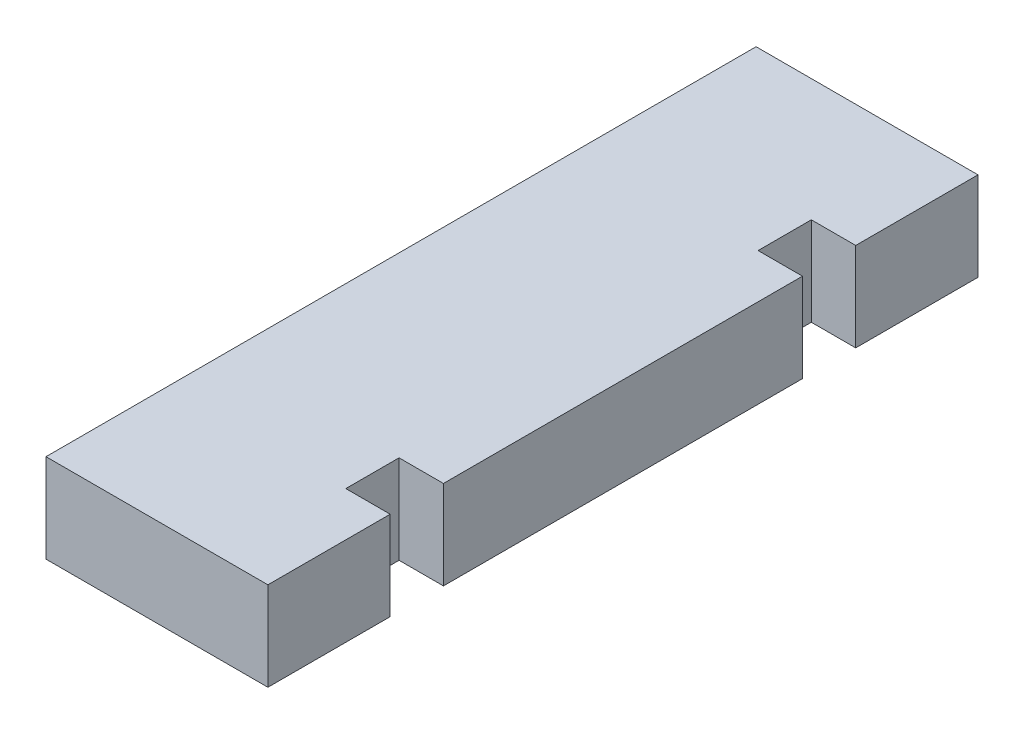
ISO-10303-21;
HEADER;
FILE_DESCRIPTION(('STEP AP214'),'2;1');
FILE_NAME('part.step','',(''),(''),'','','');
FILE_SCHEMA(('AUTOMOTIVE_DESIGN { 1 0 10303 214 1 1 1 1 }'));
ENDSEC;
DATA;
#1=APPLICATION_CONTEXT('core data for automotive mechanical design processes');
#2=APPLICATION_PROTOCOL_DEFINITION('international standard','automotive_design',2000,#1);
#3=PRODUCT_CONTEXT('',#1,'mechanical');
#4=PRODUCT('Part','Part','',(#3));
#5=PRODUCT_RELATED_PRODUCT_CATEGORY('part','',(#4));
#6=PRODUCT_DEFINITION_FORMATION('','',#4);
#7=PRODUCT_DEFINITION_CONTEXT('part definition',#1,'design');
#8=PRODUCT_DEFINITION('design','',#6,#7);
#9=PRODUCT_DEFINITION_SHAPE('','',#8);
#10=(LENGTH_UNIT() NAMED_UNIT(*) SI_UNIT(.MILLI.,.METRE.));
#11=(NAMED_UNIT(*) PLANE_ANGLE_UNIT() SI_UNIT($,.RADIAN.));
#12=(NAMED_UNIT(*) SI_UNIT($,.STERADIAN.) SOLID_ANGLE_UNIT());
#13=UNCERTAINTY_MEASURE_WITH_UNIT(LENGTH_MEASURE(1.E-05),#10,'distance_accuracy_value','');
#14=(GEOMETRIC_REPRESENTATION_CONTEXT(3) GLOBAL_UNCERTAINTY_ASSIGNED_CONTEXT((#13)) GLOBAL_UNIT_ASSIGNED_CONTEXT((#10,
#11,#12)) REPRESENTATION_CONTEXT('',''));
#15=CARTESIAN_POINT('',(0.,0.,0.));
#16=DIRECTION('',(0.,0.,1.));
#17=DIRECTION('',(1.,0.,0.));
#18=AXIS2_PLACEMENT_3D('',#15,#16,#17);
#19=CARTESIAN_POINT('',(25.,0.,-80.));
#20=DIRECTION('',(1.,0.,0.));
#21=DIRECTION('',(0.,0.,-1.));
#22=AXIS2_PLACEMENT_3D('',#19,#20,#21);
#23=PLANE('',#22);
#24=DIRECTION('',(0.,1.,0.));
#25=VECTOR('',#24,1.);
#26=CARTESIAN_POINT('',(25.,10.,-66.2237081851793));
#27=LINE('',#26,#25);
#28=CARTESIAN_POINT('',(25.,0.,-66.2237081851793));
#29=VERTEX_POINT('',#28);
#30=CARTESIAN_POINT('',(25.,10.,-66.2237081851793));
#31=VERTEX_POINT('',#30);
#32=EDGE_CURVE('E134',#29,#31,#27,.T.);
#33=ORIENTED_EDGE('',*,*,#32,.F.);
#34=DIRECTION('',(0.,0.,1.));
#35=VECTOR('',#34,1.);
#36=CARTESIAN_POINT('',(25.,0.,-80.));
#37=LINE('',#36,#35);
#38=CARTESIAN_POINT('',(25.,0.,-80.));
#39=VERTEX_POINT('',#38);
#40=EDGE_CURVE('E144',#39,#29,#37,.T.);
#41=ORIENTED_EDGE('',*,*,#40,.F.);
#42=DIRECTION('',(0.,1.,0.));
#43=VECTOR('',#42,1.);
#44=CARTESIAN_POINT('',(25.,0.,-80.));
#45=LINE('',#44,#43);
#46=CARTESIAN_POINT('',(25.,10.,-80.));
#47=VERTEX_POINT('',#46);
#48=EDGE_CURVE('E160',#39,#47,#45,.T.);
#49=ORIENTED_EDGE('',*,*,#48,.T.);
#50=DIRECTION('',(0.,0.,1.));
#51=VECTOR('',#50,1.);
#52=CARTESIAN_POINT('',(25.,10.,-80.));
#53=LINE('',#52,#51);
#54=EDGE_CURVE('E35',#47,#31,#53,.T.);
#55=ORIENTED_EDGE('',*,*,#54,.T.);
#56=EDGE_LOOP('',(#33,#41,#49,#55));
#57=FACE_BOUND('',#56,.T.);
#58=ADVANCED_FACE('F26',(#57),#23,.T.);
#59=DIRECTION('',(0.,-1.,0.));
#60=VECTOR('',#59,1.);
#61=CARTESIAN_POINT('',(25.,10.,-13.7762918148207));
#62=LINE('',#61,#60);
#63=CARTESIAN_POINT('',(25.,10.,-13.7762918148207));
#64=VERTEX_POINT('',#63);
#65=CARTESIAN_POINT('',(25.,0.,-13.7762918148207));
#66=VERTEX_POINT('',#65);
#67=EDGE_CURVE('E199',#64,#66,#62,.T.);
#68=ORIENTED_EDGE('',*,*,#67,.F.);
#69=CARTESIAN_POINT('',(25.,10.,0.));
#70=VERTEX_POINT('',#69);
#71=EDGE_CURVE('E141',#64,#70,#53,.T.);
#72=ORIENTED_EDGE('',*,*,#71,.T.);
#73=DIRECTION('',(0.,1.,0.));
#74=VECTOR('',#73,1.);
#75=CARTESIAN_POINT('',(25.,0.,0.));
#76=LINE('',#75,#74);
#77=CARTESIAN_POINT('',(25.,0.,0.));
#78=VERTEX_POINT('',#77);
#79=EDGE_CURVE('E172',#78,#70,#76,.T.);
#80=ORIENTED_EDGE('',*,*,#79,.F.);
#81=EDGE_CURVE('E147',#66,#78,#37,.T.);
#82=ORIENTED_EDGE('',*,*,#81,.F.);
#83=EDGE_LOOP('',(#68,#72,#80,#82));
#84=FACE_BOUND('',#83,.T.);
#85=ADVANCED_FACE('F230',(#84),#23,.T.);
#86=CARTESIAN_POINT('',(0.,0.,-80.));
#87=DIRECTION('',(-1.,0.,0.));
#88=DIRECTION('',(0.,0.,1.));
#89=AXIS2_PLACEMENT_3D('',#86,#87,#88);
#90=PLANE('',#89);
#91=DIRECTION('',(0.,-1.,0.));
#92=VECTOR('',#91,1.);
#93=CARTESIAN_POINT('',(0.,0.,0.));
#94=LINE('',#93,#92);
#95=CARTESIAN_POINT('',(0.,10.,0.));
#96=VERTEX_POINT('',#95);
#97=CARTESIAN_POINT('',(0.,0.,0.));
#98=VERTEX_POINT('',#97);
#99=EDGE_CURVE('E178',#96,#98,#94,.T.);
#100=ORIENTED_EDGE('',*,*,#99,.F.);
#101=DIRECTION('',(0.,0.,1.));
#102=VECTOR('',#101,1.);
#103=CARTESIAN_POINT('',(0.,10.,-80.));
#104=LINE('',#103,#102);
#105=CARTESIAN_POINT('',(0.,10.,-80.));
#106=VERTEX_POINT('',#105);
#107=EDGE_CURVE('E11',#106,#96,#104,.T.);
#108=ORIENTED_EDGE('',*,*,#107,.F.);
#109=DIRECTION('',(0.,-1.,0.));
#110=VECTOR('',#109,1.);
#111=CARTESIAN_POINT('',(0.,0.,-80.));
#112=LINE('',#111,#110);
#113=CARTESIAN_POINT('',(0.,0.,-80.));
#114=VERTEX_POINT('',#113);
#115=EDGE_CURVE('E167',#106,#114,#112,.T.);
#116=ORIENTED_EDGE('',*,*,#115,.T.);
#117=DIRECTION('',(0.,0.,1.));
#118=VECTOR('',#117,1.);
#119=CARTESIAN_POINT('',(0.,0.,-80.));
#120=LINE('',#119,#118);
#121=EDGE_CURVE('E30',#114,#98,#120,.T.);
#122=ORIENTED_EDGE('',*,*,#121,.T.);
#123=EDGE_LOOP('',(#100,#108,#116,#122));
#124=FACE_BOUND('',#123,.T.);
#125=ADVANCED_FACE('F28',(#124),#90,.T.);
#126=CARTESIAN_POINT('',(0.,10.,-80.));
#127=DIRECTION('',(0.,1.,0.));
#128=DIRECTION('',(0.,0.,1.));
#129=AXIS2_PLACEMENT_3D('',#126,#127,#128);
#130=PLANE('',#129);
#131=DIRECTION('',(1.,0.,0.));
#132=VECTOR('',#131,1.);
#133=CARTESIAN_POINT('',(20.,10.,-66.2237081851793));
#134=LINE('',#133,#132);
#135=CARTESIAN_POINT('',(20.,10.,-66.2237081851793));
#136=VERTEX_POINT('',#135);
#137=EDGE_CURVE('E200',#136,#31,#134,.T.);
#138=ORIENTED_EDGE('',*,*,#137,.T.);
#139=ORIENTED_EDGE('',*,*,#54,.F.);
#140=DIRECTION('',(-1.,0.,0.));
#141=VECTOR('',#140,1.);
#142=CARTESIAN_POINT('',(0.,10.,-80.));
#143=LINE('',#142,#141);
#144=EDGE_CURVE('E155',#47,#106,#143,.T.);
#145=ORIENTED_EDGE('',*,*,#144,.T.);
#146=ORIENTED_EDGE('',*,*,#107,.T.);
#147=DIRECTION('',(-1.,0.,0.));
#148=VECTOR('',#147,1.);
#149=CARTESIAN_POINT('',(0.,10.,0.));
#150=LINE('',#149,#148);
#151=EDGE_CURVE('E169',#70,#96,#150,.T.);
#152=ORIENTED_EDGE('',*,*,#151,.F.);
#153=ORIENTED_EDGE('',*,*,#71,.F.);
#154=DIRECTION('',(1.,0.,0.));
#155=VECTOR('',#154,1.);
#156=CARTESIAN_POINT('',(20.,10.,-13.7762918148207));
#157=LINE('',#156,#155);
#158=CARTESIAN_POINT('',(20.,10.,-13.7762918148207));
#159=VERTEX_POINT('',#158);
#160=EDGE_CURVE('E181',#159,#64,#157,.T.);
#161=ORIENTED_EDGE('',*,*,#160,.F.);
#162=DIRECTION('',(0.,0.,1.));
#163=VECTOR('',#162,1.);
#164=CARTESIAN_POINT('',(20.,10.,-13.7762918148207));
#165=LINE('',#164,#163);
#166=CARTESIAN_POINT('',(20.,10.,-19.7762918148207));
#167=VERTEX_POINT('',#166);
#168=EDGE_CURVE('E185',#167,#159,#165,.T.);
#169=ORIENTED_EDGE('',*,*,#168,.F.);
#170=DIRECTION('',(1.,0.,0.));
#171=VECTOR('',#170,1.);
#172=CARTESIAN_POINT('',(20.,10.,-19.7762918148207));
#173=LINE('',#172,#171);
#174=CARTESIAN_POINT('',(25.,10.,-19.7762918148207));
#175=VERTEX_POINT('',#174);
#176=EDGE_CURVE('E140',#167,#175,#173,.T.);
#177=ORIENTED_EDGE('',*,*,#176,.T.);
#178=CARTESIAN_POINT('',(25.,10.,-60.2237081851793));
#179=VERTEX_POINT('',#178);
#180=EDGE_CURVE('E131',#179,#175,#53,.T.);
#181=ORIENTED_EDGE('',*,*,#180,.F.);
#182=DIRECTION('',(1.,0.,0.));
#183=VECTOR('',#182,1.);
#184=CARTESIAN_POINT('',(20.,10.,-60.2237081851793));
#185=LINE('',#184,#183);
#186=CARTESIAN_POINT('',(20.,10.,-60.2237081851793));
#187=VERTEX_POINT('',#186);
#188=EDGE_CURVE('E116',#187,#179,#185,.T.);
#189=ORIENTED_EDGE('',*,*,#188,.F.);
#190=DIRECTION('',(0.,0.,1.));
#191=VECTOR('',#190,1.);
#192=CARTESIAN_POINT('',(20.,10.,-66.2237081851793));
#193=LINE('',#192,#191);
#194=EDGE_CURVE('E211',#136,#187,#193,.T.);
#195=ORIENTED_EDGE('',*,*,#194,.F.);
#196=EDGE_LOOP('',(#138,#139,#145,#146,#152,#153,#161,#169,#177,#181,#189,#195));
#197=FACE_BOUND('',#196,.T.);
#198=ADVANCED_FACE('F138',(#197),#130,.T.);
#199=DIRECTION('',(0.,-1.,0.));
#200=VECTOR('',#199,1.);
#201=CARTESIAN_POINT('',(25.,10.,-60.2237081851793));
#202=LINE('',#201,#200);
#203=CARTESIAN_POINT('',(25.,0.,-60.2237081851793));
#204=VERTEX_POINT('',#203);
#205=EDGE_CURVE('E119',#179,#204,#202,.T.);
#206=ORIENTED_EDGE('',*,*,#205,.F.);
#207=ORIENTED_EDGE('',*,*,#180,.T.);
#208=DIRECTION('',(0.,1.,0.));
#209=VECTOR('',#208,1.);
#210=CARTESIAN_POINT('',(25.,10.,-19.7762918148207));
#211=LINE('',#210,#209);
#212=CARTESIAN_POINT('',(25.,0.,-19.7762918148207));
#213=VERTEX_POINT('',#212);
#214=EDGE_CURVE('E197',#213,#175,#211,.T.);
#215=ORIENTED_EDGE('',*,*,#214,.F.);
#216=EDGE_CURVE('E133',#204,#213,#37,.T.);
#217=ORIENTED_EDGE('',*,*,#216,.F.);
#218=EDGE_LOOP('',(#206,#207,#215,#217));
#219=FACE_BOUND('',#218,.T.);
#220=ADVANCED_FACE('F129',(#219),#23,.T.);
#221=CARTESIAN_POINT('',(0.,0.,-80.));
#222=DIRECTION('',(0.,-1.,0.));
#223=DIRECTION('',(0.,0.,-1.));
#224=AXIS2_PLACEMENT_3D('',#221,#222,#223);
#225=PLANE('',#224);
#226=DIRECTION('',(1.,0.,0.));
#227=VECTOR('',#226,1.);
#228=CARTESIAN_POINT('',(20.,0.,-66.2237081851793));
#229=LINE('',#228,#227);
#230=CARTESIAN_POINT('',(20.,0.,-66.2237081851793));
#231=VERTEX_POINT('',#230);
#232=EDGE_CURVE('E203',#231,#29,#229,.T.);
#233=ORIENTED_EDGE('',*,*,#232,.F.);
#234=DIRECTION('',(0.,0.,-1.));
#235=VECTOR('',#234,1.);
#236=CARTESIAN_POINT('',(20.,0.,-66.2237081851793));
#237=LINE('',#236,#235);
#238=CARTESIAN_POINT('',(20.,0.,-60.2237081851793));
#239=VERTEX_POINT('',#238);
#240=EDGE_CURVE('E208',#239,#231,#237,.T.);
#241=ORIENTED_EDGE('',*,*,#240,.F.);
#242=DIRECTION('',(1.,0.,0.));
#243=VECTOR('',#242,1.);
#244=CARTESIAN_POINT('',(20.,0.,-60.2237081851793));
#245=LINE('',#244,#243);
#246=EDGE_CURVE('E124',#239,#204,#245,.T.);
#247=ORIENTED_EDGE('',*,*,#246,.T.);
#248=ORIENTED_EDGE('',*,*,#216,.T.);
#249=DIRECTION('',(1.,0.,0.));
#250=VECTOR('',#249,1.);
#251=CARTESIAN_POINT('',(20.,0.,-19.7762918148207));
#252=LINE('',#251,#250);
#253=CARTESIAN_POINT('',(20.,0.,-19.7762918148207));
#254=VERTEX_POINT('',#253);
#255=EDGE_CURVE('E184',#254,#213,#252,.T.);
#256=ORIENTED_EDGE('',*,*,#255,.F.);
#257=DIRECTION('',(0.,0.,-1.));
#258=VECTOR('',#257,1.);
#259=CARTESIAN_POINT('',(20.,0.,-13.7762918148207));
#260=LINE('',#259,#258);
#261=CARTESIAN_POINT('',(20.,0.,-13.7762918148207));
#262=VERTEX_POINT('',#261);
#263=EDGE_CURVE('E194',#262,#254,#260,.T.);
#264=ORIENTED_EDGE('',*,*,#263,.F.);
#265=DIRECTION('',(1.,0.,0.));
#266=VECTOR('',#265,1.);
#267=CARTESIAN_POINT('',(20.,0.,-13.7762918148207));
#268=LINE('',#267,#266);
#269=EDGE_CURVE('E182',#262,#66,#268,.T.);
#270=ORIENTED_EDGE('',*,*,#269,.T.);
#271=ORIENTED_EDGE('',*,*,#81,.T.);
#272=DIRECTION('',(1.,0.,0.));
#273=VECTOR('',#272,1.);
#274=CARTESIAN_POINT('',(0.,0.,0.));
#275=LINE('',#274,#273);
#276=EDGE_CURVE('E175',#98,#78,#275,.T.);
#277=ORIENTED_EDGE('',*,*,#276,.F.);
#278=ORIENTED_EDGE('',*,*,#121,.F.);
#279=DIRECTION('',(1.,0.,0.));
#280=VECTOR('',#279,1.);
#281=CARTESIAN_POINT('',(0.,0.,-80.));
#282=LINE('',#281,#280);
#283=EDGE_CURVE('E163',#114,#39,#282,.T.);
#284=ORIENTED_EDGE('',*,*,#283,.T.);
#285=ORIENTED_EDGE('',*,*,#40,.T.);
#286=EDGE_LOOP('',(#233,#241,#247,#248,#256,#264,#270,#271,#277,#278,#284,#285));
#287=FACE_BOUND('',#286,.T.);
#288=ADVANCED_FACE('F234',(#287),#225,.T.);
#289=CARTESIAN_POINT('',(0.,10.,-80.));
#290=DIRECTION('',(0.,0.,-1.));
#291=DIRECTION('',(-1.,0.,0.));
#292=AXIS2_PLACEMENT_3D('',#289,#290,#291);
#293=PLANE('',#292);
#294=ORIENTED_EDGE('',*,*,#115,.F.);
#295=ORIENTED_EDGE('',*,*,#144,.F.);
#296=ORIENTED_EDGE('',*,*,#48,.F.);
#297=ORIENTED_EDGE('',*,*,#283,.F.);
#298=EDGE_LOOP('',(#294,#295,#296,#297));
#299=FACE_BOUND('',#298,.T.);
#300=ADVANCED_FACE('F222',(#299),#293,.T.);
#301=CARTESIAN_POINT('',(0.,10.,0.));
#302=DIRECTION('',(0.,0.,-1.));
#303=DIRECTION('',(-1.,0.,0.));
#304=AXIS2_PLACEMENT_3D('',#301,#302,#303);
#305=PLANE('',#304);
#306=ORIENTED_EDGE('',*,*,#99,.T.);
#307=ORIENTED_EDGE('',*,*,#276,.T.);
#308=ORIENTED_EDGE('',*,*,#79,.T.);
#309=ORIENTED_EDGE('',*,*,#151,.T.);
#310=EDGE_LOOP('',(#306,#307,#308,#309));
#311=FACE_BOUND('',#310,.T.);
#312=ADVANCED_FACE('F227',(#311),#305,.F.);
#313=CARTESIAN_POINT('',(20.,10.,-13.7762918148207));
#314=DIRECTION('',(0.,0.,1.));
#315=DIRECTION('',(1.,0.,0.));
#316=AXIS2_PLACEMENT_3D('',#313,#314,#315);
#317=PLANE('',#316);
#318=ORIENTED_EDGE('',*,*,#67,.T.);
#319=ORIENTED_EDGE('',*,*,#269,.F.);
#320=DIRECTION('',(0.,-1.,0.));
#321=VECTOR('',#320,1.);
#322=CARTESIAN_POINT('',(20.,10.,-13.7762918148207));
#323=LINE('',#322,#321);
#324=EDGE_CURVE('E51',#159,#262,#323,.T.);
#325=ORIENTED_EDGE('',*,*,#324,.F.);
#326=ORIENTED_EDGE('',*,*,#160,.T.);
#327=EDGE_LOOP('',(#318,#319,#325,#326));
#328=FACE_BOUND('',#327,.T.);
#329=ADVANCED_FACE('F232',(#328),#317,.F.);
#330=CARTESIAN_POINT('',(20.,10.,-19.7762918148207));
#331=DIRECTION('',(0.,0.,-1.));
#332=DIRECTION('',(-1.,0.,0.));
#333=AXIS2_PLACEMENT_3D('',#330,#331,#332);
#334=PLANE('',#333);
#335=ORIENTED_EDGE('',*,*,#214,.T.);
#336=ORIENTED_EDGE('',*,*,#176,.F.);
#337=DIRECTION('',(0.,1.,0.));
#338=VECTOR('',#337,1.);
#339=CARTESIAN_POINT('',(20.,10.,-19.7762918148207));
#340=LINE('',#339,#338);
#341=EDGE_CURVE('E191',#254,#167,#340,.T.);
#342=ORIENTED_EDGE('',*,*,#341,.F.);
#343=ORIENTED_EDGE('',*,*,#255,.T.);
#344=EDGE_LOOP('',(#335,#336,#342,#343));
#345=FACE_BOUND('',#344,.T.);
#346=ADVANCED_FACE('F238',(#345),#334,.F.);
#347=CARTESIAN_POINT('',(20.,0.,-13.7762918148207));
#348=DIRECTION('',(1.,0.,0.));
#349=DIRECTION('',(0.,0.,-1.));
#350=AXIS2_PLACEMENT_3D('',#347,#348,#349);
#351=PLANE('',#350);
#352=ORIENTED_EDGE('',*,*,#324,.T.);
#353=ORIENTED_EDGE('',*,*,#263,.T.);
#354=ORIENTED_EDGE('',*,*,#341,.T.);
#355=ORIENTED_EDGE('',*,*,#168,.T.);
#356=EDGE_LOOP('',(#352,#353,#354,#355));
#357=FACE_BOUND('',#356,.T.);
#358=ADVANCED_FACE('F236',(#357),#351,.T.);
#359=CARTESIAN_POINT('',(20.,10.,-66.2237081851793));
#360=DIRECTION('',(0.,0.,-1.));
#361=DIRECTION('',(-1.,0.,0.));
#362=AXIS2_PLACEMENT_3D('',#359,#360,#361);
#363=PLANE('',#362);
#364=ORIENTED_EDGE('',*,*,#32,.T.);
#365=ORIENTED_EDGE('',*,*,#137,.F.);
#366=DIRECTION('',(0.,1.,0.));
#367=VECTOR('',#366,1.);
#368=CARTESIAN_POINT('',(20.,10.,-66.2237081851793));
#369=LINE('',#368,#367);
#370=EDGE_CURVE('E125',#231,#136,#369,.T.);
#371=ORIENTED_EDGE('',*,*,#370,.F.);
#372=ORIENTED_EDGE('',*,*,#232,.T.);
#373=EDGE_LOOP('',(#364,#365,#371,#372));
#374=FACE_BOUND('',#373,.T.);
#375=ADVANCED_FACE('F215',(#374),#363,.F.);
#376=CARTESIAN_POINT('',(20.,10.,-60.2237081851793));
#377=DIRECTION('',(0.,0.,1.));
#378=DIRECTION('',(1.,0.,0.));
#379=AXIS2_PLACEMENT_3D('',#376,#377,#378);
#380=PLANE('',#379);
#381=ORIENTED_EDGE('',*,*,#205,.T.);
#382=ORIENTED_EDGE('',*,*,#246,.F.);
#383=DIRECTION('',(0.,-1.,0.));
#384=VECTOR('',#383,1.);
#385=CARTESIAN_POINT('',(20.,10.,-60.2237081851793));
#386=LINE('',#385,#384);
#387=EDGE_CURVE('E43',#187,#239,#386,.T.);
#388=ORIENTED_EDGE('',*,*,#387,.F.);
#389=ORIENTED_EDGE('',*,*,#188,.T.);
#390=EDGE_LOOP('',(#381,#382,#388,#389));
#391=FACE_BOUND('',#390,.T.);
#392=ADVANCED_FACE('F118',(#391),#380,.F.);
#393=CARTESIAN_POINT('',(20.,10.,-60.2237081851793));
#394=DIRECTION('',(1.,0.,0.));
#395=DIRECTION('',(0.,0.,-1.));
#396=AXIS2_PLACEMENT_3D('',#393,#394,#395);
#397=PLANE('',#396);
#398=ORIENTED_EDGE('',*,*,#194,.T.);
#399=ORIENTED_EDGE('',*,*,#387,.T.);
#400=ORIENTED_EDGE('',*,*,#240,.T.);
#401=ORIENTED_EDGE('',*,*,#370,.T.);
#402=EDGE_LOOP('',(#398,#399,#400,#401));
#403=FACE_BOUND('',#402,.T.);
#404=ADVANCED_FACE('F309',(#403),#397,.T.);
#405=CLOSED_SHELL('',(#58,#85,#125,#198,#220,#288,#300,#312,#329,#346,#358,#375,#392,#404));
#406=MANIFOLD_SOLID_BREP('B2',#405);
#407=ADVANCED_BREP_SHAPE_REPRESENTATION('',(#18,#406),#14);
#408=SHAPE_DEFINITION_REPRESENTATION(#9,#407);
ENDSEC;
END-ISO-10303-21;
